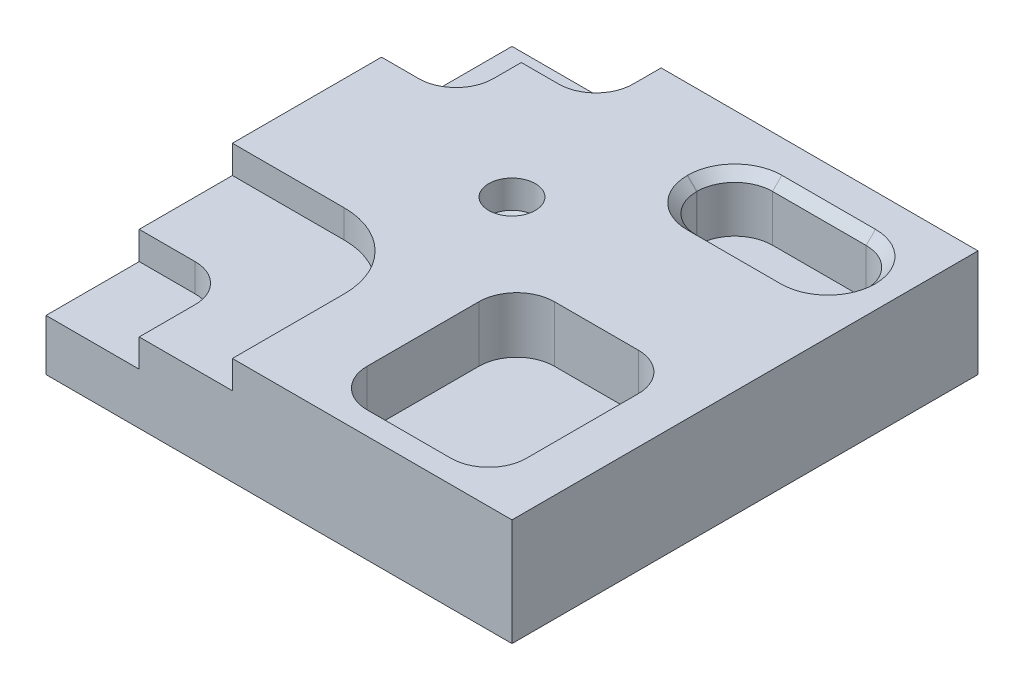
from build123d import *

# Parameters (mm, degrees)
SKETCH1_W                            = 50
SKETCH1_H                            = 50
BOSS_EXTRUDE1_DEPTH                  = 11.5
SKETCH2_W                            = 10
SKETCH2_H                            = 10
CUT_EXTRUDE1_DEPTH                   = 6
SKETCH3_W                            = 20
SKETCH3_H                            = 20
CUT_EXTRUDE2_DEPTH                   = 3
FILLET1_R                            = 8
FILLET2_R                            = 4
SKETCH4_W                            = 17.1
SKETCH4_H                            = 20.1
CUT_EXTRUDE3_DEPTH                   = 6
FILLET3_R                            = 4.05
SKETCH6_W                            = 16
SKETCH6_H                            = 7
CUT_EXTRUDE4_DEPTH                   = 6
SKETCH7_W                            = 8
SKETCH7_H                            = 7
CUT_EXTRUDE5_DEPTH                   = 6
FILLET4_R                            = 4
SKETCH9_W                            = 18.15
SKETCH9_H                            = 8.15
CUT_EXTRUDE6_DEPTH                   = 6
FILLET5_R                            = 4.05
F_97_0_11811024_DIAMETER_HOLE1_D     = 3.000000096
F_97_0_11811024_DIAMETER_HOLE1_DEPTH = 6
F_97_0_11811024_DIAMETER_HOLE1_TIP   = 0.901290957
F_97_0_19685039_DIAMETER_HOLE1_D     = 4.999999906
F_97_0_19685039_DIAMETER_HOLE1_DEPTH = 3
F_97_0_19685039_DIAMETER_HOLE1_TIP   = 1.502151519
CHAMFER1_SIZE                        = 1


with BuildPart() as part:
    # Sketch1 → Boss-Extrude1 (new body)
    with BuildSketch(Plane(origin=(0, 0, 0), x_dir=(1, 0, 0), z_dir=(0, 1, 0))):
        Rectangle(SKETCH1_W, SKETCH1_H)
    extrude(amount=BOSS_EXTRUDE1_DEPTH)

    # Sketch2 → Cut-Extrude1 (cut)
    with BuildSketch(Plane(origin=(0, 11.5, 0), x_dir=(1, 0, 0), z_dir=(0, 1, 0))):
        with Locations((-20, -20)):
            Rectangle(SKETCH2_W, SKETCH2_H)
    extrude(amount=-CUT_EXTRUDE1_DEPTH, mode=Mode.SUBTRACT)

    # Sketch3 → Cut-Extrude2 (cut)
    with BuildSketch(Plane(origin=(0, 11.5, 0), x_dir=(1, 0, 0), z_dir=(0, 1, 0))):
        with Locations((-15, -15)):
            Rectangle(SKETCH3_W, SKETCH3_H)
    extrude(amount=-CUT_EXTRUDE2_DEPTH, mode=Mode.SUBTRACT)

    # Fillet1
    fillet1_edges = [part.edges().sort_by_distance(p)[0] for p in [
        (-5, 10, 5),
    ]]
    fillet(fillet1_edges, radius=FILLET1_R)

    # Fillet2
    fillet2_edges = [part.edges().sort_by_distance(p)[0] for p in [
        (-15, 7, 15),
    ]]
    fillet(fillet2_edges, radius=FILLET2_R)

    # Sketch4 → Cut-Extrude3 (cut)
    with BuildSketch(Plane(origin=(0, 11.5, 0), x_dir=(1, 0, 0), z_dir=(0, 1, 0))):
        with Locations((11.5, -12.5)):
            Rectangle(SKETCH4_W, SKETCH4_H)
    extrude(amount=-CUT_EXTRUDE3_DEPTH, mode=Mode.SUBTRACT)

    # Fillet3
    fillet3_edges = [part.edges().sort_by_distance(p)[0] for p in [
        (20.05, 8.5, 2.45),
        (20.05, 8.5, 22.55),
        (2.95, 8.5, 22.55),
        (2.95, 8.5, 2.45),
    ]]
    fillet(fillet3_edges, radius=FILLET3_R)

    # Sketch6 → Cut-Extrude4 (cut)
    with BuildSketch(Plane(origin=(0, 11.5, 0), x_dir=(1, 0, 0), z_dir=(0, 1, 0))):
        with Locations((-17, 21.5)):
            Rectangle(SKETCH6_W, SKETCH6_H)
    extrude(amount=-CUT_EXTRUDE4_DEPTH, mode=Mode.SUBTRACT)

    # Sketch7 → Cut-Extrude5 (cut)
    with BuildSketch(Plane(origin=(0, 11.5, 0), x_dir=(1, 0, 0), z_dir=(0, 1, 0))):
        with Locations((-21, 14.5)):
            Rectangle(SKETCH7_W, SKETCH7_H)
    extrude(amount=-CUT_EXTRUDE5_DEPTH, mode=Mode.SUBTRACT)

    # Fillet4
    fillet4_edges = [part.edges().sort_by_distance(p)[0] for p in [
        (-9, 8.5, -18),
        (-17, 8.5, -11),
    ]]
    fillet(fillet4_edges, radius=FILLET4_R)

    # Sketch9 → Cut-Extrude6 (cut)
    with BuildSketch(Plane(origin=(0, 11.5, 0), x_dir=(1, 0, 0), z_dir=(0, 1, 0))):
        with Locations((12.475, 16.425)):
            Rectangle(SKETCH9_W, SKETCH9_H)
    extrude(amount=-CUT_EXTRUDE6_DEPTH, mode=Mode.SUBTRACT)

    # Fillet5
    fillet5_edges = [part.edges().sort_by_distance(p)[0] for p in [
        (21.55, 8.5, -20.5),
        (21.55, 8.5, -12.35),
        (3.4, 8.5, -12.35),
        (3.4, 8.5, -20.5),
    ]]
    fillet(fillet5_edges, radius=FILLET5_R)

    # 97 _0.11811024_ Diameter Hole1
    with Locations(Plane(origin=(0, 11.5, 0), x_dir=(1, 0, 0), z_dir=(0, 1, 0))):
        with Locations((-5, 5)):
            Hole(F_97_0_11811024_DIAMETER_HOLE1_D / 2, depth=F_97_0_11811024_DIAMETER_HOLE1_DEPTH)
            with Locations((0, 0, -(F_97_0_11811024_DIAMETER_HOLE1_DEPTH + F_97_0_11811024_DIAMETER_HOLE1_TIP / 2))):  # 118° drill point
                Cone(0, F_97_0_11811024_DIAMETER_HOLE1_D / 2, F_97_0_11811024_DIAMETER_HOLE1_TIP, mode=Mode.SUBTRACT)

    # 97 _0.19685039_ Diameter Hole1
    with Locations(Plane(origin=(-5, 11.5, -5), x_dir=(0, 0, 1), z_dir=(0, 1, 0))):
        with Locations((0, 0)):
            Hole(F_97_0_19685039_DIAMETER_HOLE1_D / 2, depth=F_97_0_19685039_DIAMETER_HOLE1_DEPTH)
            with Locations((0, 0, -(F_97_0_19685039_DIAMETER_HOLE1_DEPTH + F_97_0_19685039_DIAMETER_HOLE1_TIP / 2))):  # 118° drill point
                Cone(0, F_97_0_19685039_DIAMETER_HOLE1_D / 2, F_97_0_19685039_DIAMETER_HOLE1_TIP, mode=Mode.SUBTRACT)

    # Chamfer1
    chamfer1_edges = [part.edges().sort_by_distance(p)[0] for p in [
        (21.55, 11.5, -16.425),
        (12.475, 11.5, -12.35),
        (3.4, 11.5, -16.425),
        (12.475, 11.5, -20.5),
        (20.363782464, 11.5, -13.536217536),
        (4.586217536, 11.5, -13.536217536),
        (4.586217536, 11.5, -19.313782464),
        (20.363782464, 11.5, -19.313782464),
    ]]
    chamfer(chamfer1_edges, length=CHAMFER1_SIZE)


solid = part.part
